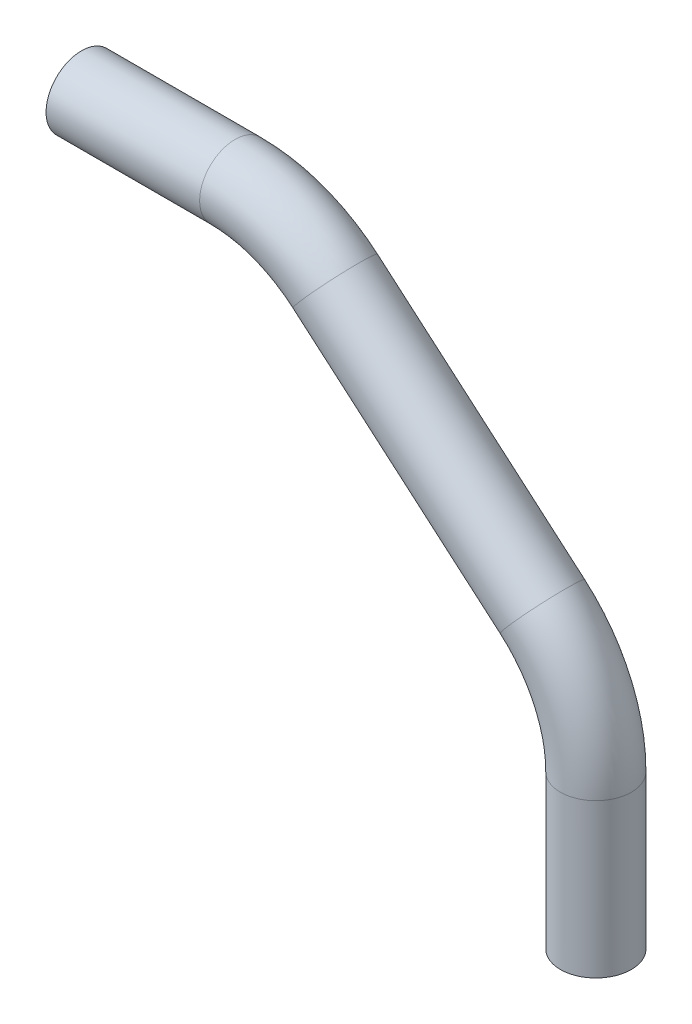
from build123d import *

# Parameters (mm, degrees)
SKETCH2_R   = 4.7625
SKETCH2_R_2 = 3.8735


with BuildPart() as part:
    # Sweep1: sweep along a path in Sketch1
    with BuildLine(Plane.XY) as sweep1_path:
        Line((0, 0), (0, 20.6375))
        ThreePointArc((0, 20.6375), (-1.880890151, 29.245402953), (-7.180714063, 36.28426703))
        Line((-7.180714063, 36.28426703), (-35.029734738, 60.235432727))
        ThreePointArc((-35.029734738, 60.235432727), (-41.310301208, 63.938298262), (-48.486520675, 65.226165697))
        Line((-48.486520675, 65.226165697), (-69.124020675, 65.226165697))
    # Sketch2 → Sweep1 (sweep)
    with BuildSketch(Plane(origin=(0, 0, 0), x_dir=(1, 0, 0), z_dir=(0, 1, 0))):
        Circle(SKETCH2_R)
        Circle(SKETCH2_R_2, mode=Mode.SUBTRACT)
    sweep(path=sweep1_path.line)


solid = part.part
